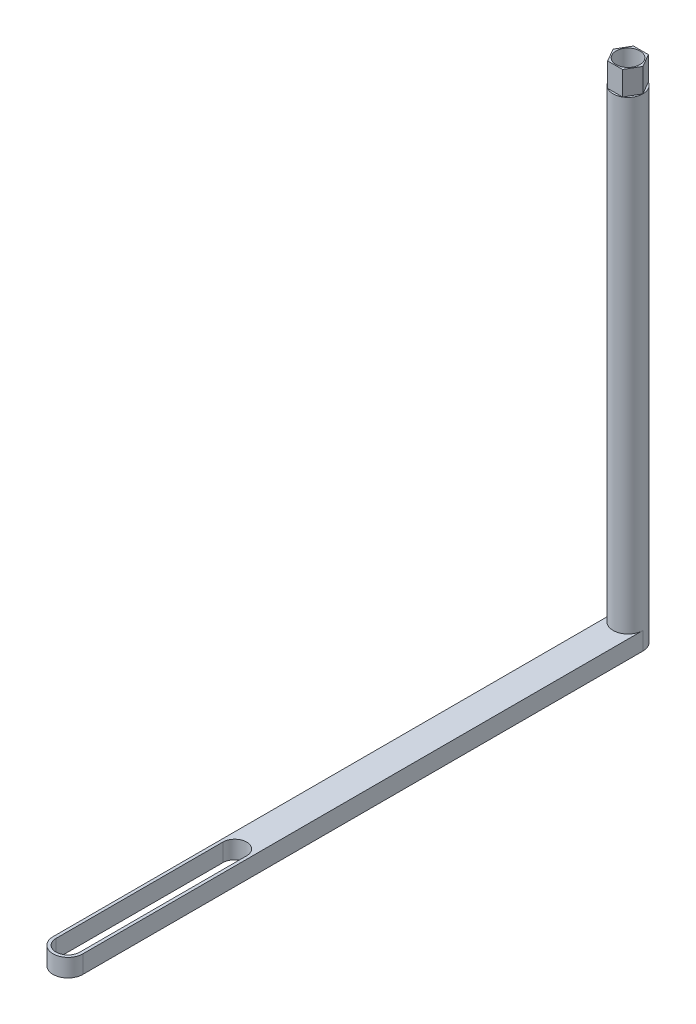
ISO-10303-21;
HEADER;
FILE_DESCRIPTION(('STEP AP214'),'2;1');
FILE_NAME('part.step','',(''),(''),'','','');
FILE_SCHEMA(('AUTOMOTIVE_DESIGN { 1 0 10303 214 1 1 1 1 }'));
ENDSEC;
DATA;
#1=APPLICATION_CONTEXT('core data for automotive mechanical design processes');
#2=APPLICATION_PROTOCOL_DEFINITION('international standard','automotive_design',2000,#1);
#3=PRODUCT_CONTEXT('',#1,'mechanical');
#4=PRODUCT('Part','Part','',(#3));
#5=PRODUCT_RELATED_PRODUCT_CATEGORY('part','',(#4));
#6=PRODUCT_DEFINITION_FORMATION('','',#4);
#7=PRODUCT_DEFINITION_CONTEXT('part definition',#1,'design');
#8=PRODUCT_DEFINITION('design','',#6,#7);
#9=PRODUCT_DEFINITION_SHAPE('','',#8);
#10=(LENGTH_UNIT() NAMED_UNIT(*) SI_UNIT(.MILLI.,.METRE.));
#11=(NAMED_UNIT(*) PLANE_ANGLE_UNIT() SI_UNIT($,.RADIAN.));
#12=(NAMED_UNIT(*) SI_UNIT($,.STERADIAN.) SOLID_ANGLE_UNIT());
#13=UNCERTAINTY_MEASURE_WITH_UNIT(LENGTH_MEASURE(1.E-05),#10,'distance_accuracy_value','');
#14=(GEOMETRIC_REPRESENTATION_CONTEXT(3) GLOBAL_UNCERTAINTY_ASSIGNED_CONTEXT((#13)) GLOBAL_UNIT_ASSIGNED_CONTEXT((#10,
#11,#12)) REPRESENTATION_CONTEXT('',''));
#15=CARTESIAN_POINT('',(0.,0.,0.));
#16=DIRECTION('',(0.,0.,1.));
#17=DIRECTION('',(1.,0.,0.));
#18=AXIS2_PLACEMENT_3D('',#15,#16,#17);
#19=CARTESIAN_POINT('',(0.,42.5,0.));
#20=DIRECTION('',(0.,-1.,0.));
#21=DIRECTION('',(0.,0.,-1.));
#22=AXIS2_PLACEMENT_3D('',#19,#20,#21);
#23=CYLINDRICAL_SURFACE('',#22,1.25);
#24=CARTESIAN_POINT('',(0.,1.5,0.));
#25=DIRECTION('',(0.,-1.,0.));
#26=DIRECTION('',(0.,0.,-1.));
#27=AXIS2_PLACEMENT_3D('',#24,#25,#26);
#28=CIRCLE('',#27,1.25);
#29=CARTESIAN_POINT('',(1.25,1.5,0.));
#30=VERTEX_POINT('',#29);
#31=CARTESIAN_POINT('',(-1.25,1.5,0.));
#32=VERTEX_POINT('',#31);
#33=EDGE_CURVE('E49',#30,#32,#28,.T.);
#34=ORIENTED_EDGE('',*,*,#33,.F.);
#35=DIRECTION('',(0.,-1.,0.));
#36=VECTOR('',#35,1.);
#37=CARTESIAN_POINT('',(1.25,1.5,0.));
#38=LINE('',#37,#36);
#39=CARTESIAN_POINT('',(1.25,0.,0.));
#40=VERTEX_POINT('',#39);
#41=EDGE_CURVE('E218',#30,#40,#38,.T.);
#42=ORIENTED_EDGE('',*,*,#41,.T.);
#43=CARTESIAN_POINT('',(0.,0.,0.));
#44=DIRECTION('',(0.,1.,0.));
#45=DIRECTION('',(0.,0.,1.));
#46=AXIS2_PLACEMENT_3D('',#43,#44,#45);
#47=CIRCLE('',#46,1.25);
#48=CARTESIAN_POINT('',(-1.25,0.,0.));
#49=VERTEX_POINT('',#48);
#50=EDGE_CURVE('E11',#40,#49,#47,.T.);
#51=ORIENTED_EDGE('',*,*,#50,.T.);
#52=DIRECTION('',(0.,-1.,0.));
#53=VECTOR('',#52,1.);
#54=CARTESIAN_POINT('',(-1.25,1.5,0.));
#55=LINE('',#54,#53);
#56=EDGE_CURVE('E53',#32,#49,#55,.T.);
#57=ORIENTED_EDGE('',*,*,#56,.F.);
#58=EDGE_LOOP('',(#34,#42,#51,#57));
#59=FACE_BOUND('',#58,.T.);
#60=CARTESIAN_POINT('',(0.,40.5,0.));
#61=DIRECTION('',(0.,1.,0.));
#62=DIRECTION('',(0.,0.,1.));
#63=AXIS2_PLACEMENT_3D('',#60,#61,#62);
#64=CIRCLE('',#63,1.25);
#65=CARTESIAN_POINT('',(-0.625000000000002,40.5,1.08253175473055));
#66=VERTEX_POINT('',#65);
#67=CARTESIAN_POINT('',(0.624999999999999,40.5,1.08253175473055));
#68=VERTEX_POINT('',#67);
#69=EDGE_CURVE('E150',#66,#68,#64,.T.);
#70=ORIENTED_EDGE('',*,*,#69,.F.);
#71=CARTESIAN_POINT('',(0.,40.5,0.));
#72=DIRECTION('',(0.,1.,0.));
#73=DIRECTION('',(0.,0.,1.));
#74=AXIS2_PLACEMENT_3D('',#71,#72,#73);
#75=CIRCLE('',#74,1.25);
#76=CARTESIAN_POINT('',(-1.25,40.5,0.));
#77=VERTEX_POINT('',#76);
#78=EDGE_CURVE('E158',#77,#66,#75,.T.);
#79=ORIENTED_EDGE('',*,*,#78,.F.);
#80=CARTESIAN_POINT('',(0.,40.5,0.));
#81=DIRECTION('',(0.,1.,0.));
#82=DIRECTION('',(0.,0.,1.));
#83=AXIS2_PLACEMENT_3D('',#80,#81,#82);
#84=CIRCLE('',#83,1.25);
#85=CARTESIAN_POINT('',(-0.624999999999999,40.5,-1.08253175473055));
#86=VERTEX_POINT('',#85);
#87=EDGE_CURVE('E266',#86,#77,#84,.T.);
#88=ORIENTED_EDGE('',*,*,#87,.F.);
#89=CARTESIAN_POINT('',(0.,40.5,0.));
#90=DIRECTION('',(0.,1.,0.));
#91=DIRECTION('',(0.,0.,1.));
#92=AXIS2_PLACEMENT_3D('',#89,#90,#91);
#93=CIRCLE('',#92,1.25);
#94=CARTESIAN_POINT('',(0.625000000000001,40.5,-1.08253175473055));
#95=VERTEX_POINT('',#94);
#96=EDGE_CURVE('E269',#95,#86,#93,.T.);
#97=ORIENTED_EDGE('',*,*,#96,.F.);
#98=CARTESIAN_POINT('',(0.,40.5,0.));
#99=DIRECTION('',(0.,1.,0.));
#100=DIRECTION('',(0.,0.,1.));
#101=AXIS2_PLACEMENT_3D('',#98,#99,#100);
#102=CIRCLE('',#101,1.25);
#103=CARTESIAN_POINT('',(1.25,40.5,0.));
#104=VERTEX_POINT('',#103);
#105=EDGE_CURVE('E278',#104,#95,#102,.T.);
#106=ORIENTED_EDGE('',*,*,#105,.F.);
#107=CARTESIAN_POINT('',(0.,40.5,0.));
#108=DIRECTION('',(0.,1.,0.));
#109=DIRECTION('',(0.,0.,1.));
#110=AXIS2_PLACEMENT_3D('',#107,#108,#109);
#111=CIRCLE('',#110,1.25);
#112=EDGE_CURVE('E160',#68,#104,#111,.T.);
#113=ORIENTED_EDGE('',*,*,#112,.F.);
#114=EDGE_LOOP('',(#70,#79,#88,#97,#106,#113));
#115=FACE_BOUND('',#114,.T.);
#116=ADVANCED_FACE('F35',(#59,#115),#23,.T.);
#117=CARTESIAN_POINT('',(0.,42.5,0.));
#118=DIRECTION('',(0.,1.,0.));
#119=DIRECTION('',(0.,0.,1.));
#120=AXIS2_PLACEMENT_3D('',#117,#118,#119);
#121=PLANE('',#120);
#122=CARTESIAN_POINT('',(0.,42.5,0.));
#123=DIRECTION('',(0.,1.,0.));
#124=DIRECTION('',(0.,0.,1.));
#125=AXIS2_PLACEMENT_3D('',#122,#123,#124);
#126=CIRCLE('',#125,1.);
#127=CARTESIAN_POINT('',(0.,42.5,1.));
#128=VERTEX_POINT('',#127);
#129=EDGE_CURVE('E42',#128,#128,#126,.T.);
#130=ORIENTED_EDGE('',*,*,#129,.F.);
#131=EDGE_LOOP('',(#130));
#132=FACE_BOUND('',#131,.T.);
#133=DIRECTION('',(0.5,0.,0.866025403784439));
#134=VECTOR('',#133,1.);
#135=CARTESIAN_POINT('',(-0.937500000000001,42.5,0.541265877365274));
#136=LINE('',#135,#134);
#137=CARTESIAN_POINT('',(-1.25,42.5,0.));
#138=VERTEX_POINT('',#137);
#139=CARTESIAN_POINT('',(-0.625000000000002,42.5,1.08253175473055));
#140=VERTEX_POINT('',#139);
#141=EDGE_CURVE('E167',#138,#140,#136,.T.);
#142=ORIENTED_EDGE('',*,*,#141,.T.);
#143=DIRECTION('',(1.,0.,0.));
#144=VECTOR('',#143,1.);
#145=CARTESIAN_POINT('',(0.,42.5,1.08253175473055));
#146=LINE('',#145,#144);
#147=CARTESIAN_POINT('',(0.624999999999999,42.5,1.08253175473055));
#148=VERTEX_POINT('',#147);
#149=EDGE_CURVE('E139',#140,#148,#146,.T.);
#150=ORIENTED_EDGE('',*,*,#149,.T.);
#151=DIRECTION('',(0.5,0.,-0.866025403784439));
#152=VECTOR('',#151,1.);
#153=CARTESIAN_POINT('',(0.937500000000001,42.5,0.541265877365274));
#154=LINE('',#153,#152);
#155=CARTESIAN_POINT('',(1.25,42.5,0.));
#156=VERTEX_POINT('',#155);
#157=EDGE_CURVE('E151',#148,#156,#154,.T.);
#158=ORIENTED_EDGE('',*,*,#157,.T.);
#159=DIRECTION('',(-0.5,0.,-0.866025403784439));
#160=VECTOR('',#159,1.);
#161=CARTESIAN_POINT('',(0.937500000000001,42.5,-0.541265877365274));
#162=LINE('',#161,#160);
#163=CARTESIAN_POINT('',(0.625000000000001,42.5,-1.08253175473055));
#164=VERTEX_POINT('',#163);
#165=EDGE_CURVE('E291',#156,#164,#162,.T.);
#166=ORIENTED_EDGE('',*,*,#165,.T.);
#167=DIRECTION('',(-1.,0.,0.));
#168=VECTOR('',#167,1.);
#169=CARTESIAN_POINT('',(0.,42.5,-1.08253175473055));
#170=LINE('',#169,#168);
#171=CARTESIAN_POINT('',(-0.624999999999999,42.5,-1.08253175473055));
#172=VERTEX_POINT('',#171);
#173=EDGE_CURVE('E260',#164,#172,#170,.T.);
#174=ORIENTED_EDGE('',*,*,#173,.T.);
#175=DIRECTION('',(-0.5,0.,0.866025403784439));
#176=VECTOR('',#175,1.);
#177=CARTESIAN_POINT('',(-0.9375,42.5,-0.541265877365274));
#178=LINE('',#177,#176);
#179=EDGE_CURVE('E257',#172,#138,#178,.T.);
#180=ORIENTED_EDGE('',*,*,#179,.T.);
#181=EDGE_LOOP('',(#142,#150,#158,#166,#174,#180));
#182=FACE_BOUND('',#181,.T.);
#183=ADVANCED_FACE('F248',(#132,#182),#121,.T.);
#184=CARTESIAN_POINT('',(0.,0.,0.));
#185=DIRECTION('',(0.,1.,0.));
#186=DIRECTION('',(0.,0.,1.));
#187=AXIS2_PLACEMENT_3D('',#184,#185,#186);
#188=PLANE('',#187);
#189=ORIENTED_EDGE('',*,*,#50,.F.);
#190=DIRECTION('',(0.,0.,1.));
#191=VECTOR('',#190,1.);
#192=CARTESIAN_POINT('',(1.25,0.,0.));
#193=LINE('',#192,#191);
#194=CARTESIAN_POINT('',(1.25,0.,47.));
#195=VERTEX_POINT('',#194);
#196=EDGE_CURVE('E201',#40,#195,#193,.T.);
#197=ORIENTED_EDGE('',*,*,#196,.T.);
#198=CARTESIAN_POINT('',(0.,0.,47.));
#199=DIRECTION('',(0.,-1.,0.));
#200=DIRECTION('',(0.,0.,-1.));
#201=AXIS2_PLACEMENT_3D('',#198,#199,#200);
#202=CIRCLE('',#201,1.25);
#203=CARTESIAN_POINT('',(-1.25,0.,47.));
#204=VERTEX_POINT('',#203);
#205=EDGE_CURVE('E221',#195,#204,#202,.T.);
#206=ORIENTED_EDGE('',*,*,#205,.T.);
#207=DIRECTION('',(0.,0.,-1.));
#208=VECTOR('',#207,1.);
#209=CARTESIAN_POINT('',(-1.25,0.,0.));
#210=LINE('',#209,#208);
#211=EDGE_CURVE('E212',#204,#49,#210,.T.);
#212=ORIENTED_EDGE('',*,*,#211,.T.);
#213=EDGE_LOOP('',(#189,#197,#206,#212));
#214=FACE_BOUND('',#213,.T.);
#215=CARTESIAN_POINT('',(0.,0.,0.));
#216=DIRECTION('',(0.,1.,0.));
#217=DIRECTION('',(0.,0.,1.));
#218=AXIS2_PLACEMENT_3D('',#215,#216,#217);
#219=CIRCLE('',#218,1.);
#220=CARTESIAN_POINT('',(0.,0.,1.));
#221=VERTEX_POINT('',#220);
#222=EDGE_CURVE('E233',#221,#221,#219,.T.);
#223=ORIENTED_EDGE('',*,*,#222,.T.);
#224=EDGE_LOOP('',(#223));
#225=FACE_BOUND('',#224,.T.);
#226=CARTESIAN_POINT('',(0.,0.,47.));
#227=DIRECTION('',(0.,-1.,0.));
#228=DIRECTION('',(0.,0.,-1.));
#229=AXIS2_PLACEMENT_3D('',#226,#227,#228);
#230=CIRCLE('',#229,1.);
#231=CARTESIAN_POINT('',(1.,0.,47.));
#232=VERTEX_POINT('',#231);
#233=CARTESIAN_POINT('',(-1.,0.,47.));
#234=VERTEX_POINT('',#233);
#235=EDGE_CURVE('E144',#232,#234,#230,.T.);
#236=ORIENTED_EDGE('',*,*,#235,.F.);
#237=DIRECTION('',(0.,0.,1.));
#238=VECTOR('',#237,1.);
#239=CARTESIAN_POINT('',(1.,0.,47.));
#240=LINE('',#239,#238);
#241=CARTESIAN_POINT('',(1.,0.,33.));
#242=VERTEX_POINT('',#241);
#243=EDGE_CURVE('E180',#242,#232,#240,.T.);
#244=ORIENTED_EDGE('',*,*,#243,.F.);
#245=CARTESIAN_POINT('',(0.,0.,33.));
#246=DIRECTION('',(0.,-1.,0.));
#247=DIRECTION('',(0.,0.,-1.));
#248=AXIS2_PLACEMENT_3D('',#245,#246,#247);
#249=CIRCLE('',#248,1.);
#250=CARTESIAN_POINT('',(-0.999999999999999,0.,33.));
#251=VERTEX_POINT('',#250);
#252=EDGE_CURVE('E194',#251,#242,#249,.T.);
#253=ORIENTED_EDGE('',*,*,#252,.F.);
#254=DIRECTION('',(0.,0.,-1.));
#255=VECTOR('',#254,1.);
#256=CARTESIAN_POINT('',(-1.,0.,47.));
#257=LINE('',#256,#255);
#258=EDGE_CURVE('E191',#234,#251,#257,.T.);
#259=ORIENTED_EDGE('',*,*,#258,.F.);
#260=EDGE_LOOP('',(#236,#244,#253,#259));
#261=FACE_BOUND('',#260,.T.);
#262=ADVANCED_FACE('F238',(#214,#225,#261),#188,.F.);
#263=CARTESIAN_POINT('',(0.,42.5,0.));
#264=DIRECTION('',(0.,-1.,0.));
#265=DIRECTION('',(0.,0.,-1.));
#266=AXIS2_PLACEMENT_3D('',#263,#264,#265);
#267=CYLINDRICAL_SURFACE('',#266,1.);
#268=ORIENTED_EDGE('',*,*,#222,.F.);
#269=EDGE_LOOP('',(#268));
#270=FACE_BOUND('',#269,.T.);
#271=ORIENTED_EDGE('',*,*,#129,.T.);
#272=EDGE_LOOP('',(#271));
#273=FACE_BOUND('',#272,.T.);
#274=ADVANCED_FACE('F241',(#270,#273),#267,.F.);
#275=CARTESIAN_POINT('',(0.,1.5,0.));
#276=DIRECTION('',(0.,-1.,0.));
#277=DIRECTION('',(0.,0.,-1.));
#278=AXIS2_PLACEMENT_3D('',#275,#276,#277);
#279=PLANE('',#278);
#280=DIRECTION('',(0.,0.,1.));
#281=VECTOR('',#280,1.);
#282=CARTESIAN_POINT('',(1.,1.5,47.));
#283=LINE('',#282,#281);
#284=CARTESIAN_POINT('',(1.,1.5,33.));
#285=VERTEX_POINT('',#284);
#286=CARTESIAN_POINT('',(1.,1.5,47.));
#287=VERTEX_POINT('',#286);
#288=EDGE_CURVE('E186',#285,#287,#283,.T.);
#289=ORIENTED_EDGE('',*,*,#288,.T.);
#290=CARTESIAN_POINT('',(0.,1.5,47.));
#291=DIRECTION('',(0.,-1.,0.));
#292=DIRECTION('',(0.,0.,-1.));
#293=AXIS2_PLACEMENT_3D('',#290,#291,#292);
#294=CIRCLE('',#293,1.);
#295=CARTESIAN_POINT('',(-1.,1.5,47.));
#296=VERTEX_POINT('',#295);
#297=EDGE_CURVE('E176',#287,#296,#294,.T.);
#298=ORIENTED_EDGE('',*,*,#297,.T.);
#299=DIRECTION('',(0.,0.,-1.));
#300=VECTOR('',#299,1.);
#301=CARTESIAN_POINT('',(-1.,1.5,47.));
#302=LINE('',#301,#300);
#303=CARTESIAN_POINT('',(-0.999999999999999,1.5,33.));
#304=VERTEX_POINT('',#303);
#305=EDGE_CURVE('E179',#296,#304,#302,.T.);
#306=ORIENTED_EDGE('',*,*,#305,.T.);
#307=CARTESIAN_POINT('',(0.,1.5,33.));
#308=DIRECTION('',(0.,-1.,0.));
#309=DIRECTION('',(0.,0.,-1.));
#310=AXIS2_PLACEMENT_3D('',#307,#308,#309);
#311=CIRCLE('',#310,1.);
#312=EDGE_CURVE('E183',#304,#285,#311,.T.);
#313=ORIENTED_EDGE('',*,*,#312,.T.);
#314=EDGE_LOOP('',(#289,#298,#306,#313));
#315=FACE_BOUND('',#314,.T.);
#316=DIRECTION('',(0.,0.,1.));
#317=VECTOR('',#316,1.);
#318=CARTESIAN_POINT('',(1.25,1.5,0.));
#319=LINE('',#318,#317);
#320=CARTESIAN_POINT('',(1.25,1.5,47.));
#321=VERTEX_POINT('',#320);
#322=EDGE_CURVE('E208',#30,#321,#319,.T.);
#323=ORIENTED_EDGE('',*,*,#322,.F.);
#324=ORIENTED_EDGE('',*,*,#33,.T.);
#325=DIRECTION('',(0.,0.,-1.));
#326=VECTOR('',#325,1.);
#327=CARTESIAN_POINT('',(-1.25,1.5,0.));
#328=LINE('',#327,#326);
#329=CARTESIAN_POINT('',(-1.25,1.5,47.));
#330=VERTEX_POINT('',#329);
#331=EDGE_CURVE('E215',#330,#32,#328,.T.);
#332=ORIENTED_EDGE('',*,*,#331,.F.);
#333=CARTESIAN_POINT('',(0.,1.5,47.));
#334=DIRECTION('',(0.,-1.,0.));
#335=DIRECTION('',(0.,0.,-1.));
#336=AXIS2_PLACEMENT_3D('',#333,#334,#335);
#337=CIRCLE('',#336,1.25);
#338=EDGE_CURVE('E211',#321,#330,#337,.T.);
#339=ORIENTED_EDGE('',*,*,#338,.F.);
#340=EDGE_LOOP('',(#323,#324,#332,#339));
#341=FACE_BOUND('',#340,.T.);
#342=ADVANCED_FACE('F244',(#315,#341),#279,.F.);
#343=CARTESIAN_POINT('',(-1.25,1.5,0.));
#344=DIRECTION('',(-1.,0.,0.));
#345=DIRECTION('',(0.,0.,1.));
#346=AXIS2_PLACEMENT_3D('',#343,#344,#345);
#347=PLANE('',#346);
#348=ORIENTED_EDGE('',*,*,#211,.F.);
#349=DIRECTION('',(0.,-1.,0.));
#350=VECTOR('',#349,1.);
#351=CARTESIAN_POINT('',(-1.25,1.5,47.));
#352=LINE('',#351,#350);
#353=EDGE_CURVE('E227',#330,#204,#352,.T.);
#354=ORIENTED_EDGE('',*,*,#353,.F.);
#355=ORIENTED_EDGE('',*,*,#331,.T.);
#356=ORIENTED_EDGE('',*,*,#56,.T.);
#357=EDGE_LOOP('',(#348,#354,#355,#356));
#358=FACE_BOUND('',#357,.T.);
#359=ADVANCED_FACE('F342',(#358),#347,.T.);
#360=CARTESIAN_POINT('',(0.,1.5,47.));
#361=DIRECTION('',(0.,-1.,0.));
#362=DIRECTION('',(0.,0.,-1.));
#363=AXIS2_PLACEMENT_3D('',#360,#361,#362);
#364=CYLINDRICAL_SURFACE('',#363,1.25);
#365=ORIENTED_EDGE('',*,*,#205,.F.);
#366=DIRECTION('',(0.,-1.,0.));
#367=VECTOR('',#366,1.);
#368=CARTESIAN_POINT('',(1.25,1.5,47.));
#369=LINE('',#368,#367);
#370=EDGE_CURVE('E229',#321,#195,#369,.T.);
#371=ORIENTED_EDGE('',*,*,#370,.F.);
#372=ORIENTED_EDGE('',*,*,#338,.T.);
#373=ORIENTED_EDGE('',*,*,#353,.T.);
#374=EDGE_LOOP('',(#365,#371,#372,#373));
#375=FACE_BOUND('',#374,.T.);
#376=ADVANCED_FACE('F350',(#375),#364,.T.);
#377=CARTESIAN_POINT('',(1.25,1.5,0.));
#378=DIRECTION('',(1.,0.,0.));
#379=DIRECTION('',(0.,0.,-1.));
#380=AXIS2_PLACEMENT_3D('',#377,#378,#379);
#381=PLANE('',#380);
#382=ORIENTED_EDGE('',*,*,#196,.F.);
#383=ORIENTED_EDGE('',*,*,#41,.F.);
#384=ORIENTED_EDGE('',*,*,#322,.T.);
#385=ORIENTED_EDGE('',*,*,#370,.T.);
#386=EDGE_LOOP('',(#382,#383,#384,#385));
#387=FACE_BOUND('',#386,.T.);
#388=ADVANCED_FACE('F358',(#387),#381,.T.);
#389=CARTESIAN_POINT('',(0.,1.5,47.));
#390=DIRECTION('',(0.,-1.,0.));
#391=DIRECTION('',(0.,0.,-1.));
#392=AXIS2_PLACEMENT_3D('',#389,#390,#391);
#393=CYLINDRICAL_SURFACE('',#392,1.);
#394=ORIENTED_EDGE('',*,*,#235,.T.);
#395=DIRECTION('',(0.,-1.,0.));
#396=VECTOR('',#395,1.);
#397=CARTESIAN_POINT('',(-1.,1.5,47.));
#398=LINE('',#397,#396);
#399=EDGE_CURVE('E189',#296,#234,#398,.T.);
#400=ORIENTED_EDGE('',*,*,#399,.F.);
#401=ORIENTED_EDGE('',*,*,#297,.F.);
#402=DIRECTION('',(0.,-1.,0.));
#403=VECTOR('',#402,1.);
#404=CARTESIAN_POINT('',(1.,1.5,47.));
#405=LINE('',#404,#403);
#406=EDGE_CURVE('E199',#287,#232,#405,.T.);
#407=ORIENTED_EDGE('',*,*,#406,.T.);
#408=EDGE_LOOP('',(#394,#400,#401,#407));
#409=FACE_BOUND('',#408,.T.);
#410=ADVANCED_FACE('F366',(#409),#393,.F.);
#411=CARTESIAN_POINT('',(1.,1.5,47.));
#412=DIRECTION('',(1.,0.,0.));
#413=DIRECTION('',(0.,0.,-1.));
#414=AXIS2_PLACEMENT_3D('',#411,#412,#413);
#415=PLANE('',#414);
#416=ORIENTED_EDGE('',*,*,#243,.T.);
#417=ORIENTED_EDGE('',*,*,#406,.F.);
#418=ORIENTED_EDGE('',*,*,#288,.F.);
#419=DIRECTION('',(0.,-1.,0.));
#420=VECTOR('',#419,1.);
#421=CARTESIAN_POINT('',(1.,1.5,33.));
#422=LINE('',#421,#420);
#423=EDGE_CURVE('E202',#285,#242,#422,.T.);
#424=ORIENTED_EDGE('',*,*,#423,.T.);
#425=EDGE_LOOP('',(#416,#417,#418,#424));
#426=FACE_BOUND('',#425,.T.);
#427=ADVANCED_FACE('F374',(#426),#415,.F.);
#428=CARTESIAN_POINT('',(0.,1.5,33.));
#429=DIRECTION('',(0.,-1.,0.));
#430=DIRECTION('',(0.,0.,-1.));
#431=AXIS2_PLACEMENT_3D('',#428,#429,#430);
#432=CYLINDRICAL_SURFACE('',#431,1.);
#433=ORIENTED_EDGE('',*,*,#252,.T.);
#434=ORIENTED_EDGE('',*,*,#423,.F.);
#435=ORIENTED_EDGE('',*,*,#312,.F.);
#436=DIRECTION('',(0.,-1.,0.));
#437=VECTOR('',#436,1.);
#438=CARTESIAN_POINT('',(-0.999999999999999,1.5,33.));
#439=LINE('',#438,#437);
#440=EDGE_CURVE('E204',#304,#251,#439,.T.);
#441=ORIENTED_EDGE('',*,*,#440,.T.);
#442=EDGE_LOOP('',(#433,#434,#435,#441));
#443=FACE_BOUND('',#442,.T.);
#444=ADVANCED_FACE('F382',(#443),#432,.F.);
#445=CARTESIAN_POINT('',(-1.,1.5,47.));
#446=DIRECTION('',(-1.,0.,0.));
#447=DIRECTION('',(0.,0.,1.));
#448=AXIS2_PLACEMENT_3D('',#445,#446,#447);
#449=PLANE('',#448);
#450=ORIENTED_EDGE('',*,*,#258,.T.);
#451=ORIENTED_EDGE('',*,*,#440,.F.);
#452=ORIENTED_EDGE('',*,*,#305,.F.);
#453=ORIENTED_EDGE('',*,*,#399,.T.);
#454=EDGE_LOOP('',(#450,#451,#452,#453));
#455=FACE_BOUND('',#454,.T.);
#456=ADVANCED_FACE('F390',(#455),#449,.F.);
#457=CARTESIAN_POINT('',(-0.937500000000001,40.5,0.541265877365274));
#458=DIRECTION('',(-0.866025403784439,0.,0.5));
#459=DIRECTION('',(0.5,0.,0.866025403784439));
#460=AXIS2_PLACEMENT_3D('',#457,#458,#459);
#461=PLANE('',#460);
#462=ORIENTED_EDGE('',*,*,#141,.F.);
#463=DIRECTION('',(0.,1.,0.));
#464=VECTOR('',#463,1.);
#465=CARTESIAN_POINT('',(-1.25,40.5,0.));
#466=LINE('',#465,#464);
#467=EDGE_CURVE('E145',#77,#138,#466,.T.);
#468=ORIENTED_EDGE('',*,*,#467,.F.);
#469=DIRECTION('',(0.5,0.,0.866025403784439));
#470=VECTOR('',#469,1.);
#471=CARTESIAN_POINT('',(-0.937500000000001,40.5,0.541265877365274));
#472=LINE('',#471,#470);
#473=EDGE_CURVE('E164',#77,#66,#472,.T.);
#474=ORIENTED_EDGE('',*,*,#473,.T.);
#475=DIRECTION('',(0.,1.,0.));
#476=VECTOR('',#475,1.);
#477=CARTESIAN_POINT('',(-0.625000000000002,40.5,1.08253175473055));
#478=LINE('',#477,#476);
#479=EDGE_CURVE('E133',#66,#140,#478,.T.);
#480=ORIENTED_EDGE('',*,*,#479,.T.);
#481=EDGE_LOOP('',(#462,#468,#474,#480));
#482=FACE_BOUND('',#481,.T.);
#483=ADVANCED_FACE('F165',(#482),#461,.T.);
#484=CARTESIAN_POINT('',(0.,40.5,0.));
#485=DIRECTION('',(0.,1.,0.));
#486=DIRECTION('',(0.,0.,1.));
#487=AXIS2_PLACEMENT_3D('',#484,#485,#486);
#488=PLANE('',#487);
#489=ORIENTED_EDGE('',*,*,#473,.F.);
#490=ORIENTED_EDGE('',*,*,#78,.T.);
#491=EDGE_LOOP('',(#489,#490));
#492=FACE_BOUND('',#491,.T.);
#493=ADVANCED_FACE('F169',(#492),#488,.T.);
#494=CARTESIAN_POINT('',(-0.9375,40.5,-0.541265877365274));
#495=DIRECTION('',(-0.866025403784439,0.,-0.5));
#496=DIRECTION('',(-0.5,0.,0.866025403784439));
#497=AXIS2_PLACEMENT_3D('',#494,#495,#496);
#498=PLANE('',#497);
#499=ORIENTED_EDGE('',*,*,#179,.F.);
#500=DIRECTION('',(0.,1.,0.));
#501=VECTOR('',#500,1.);
#502=CARTESIAN_POINT('',(-0.624999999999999,40.5,-1.08253175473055));
#503=LINE('',#502,#501);
#504=EDGE_CURVE('E263',#86,#172,#503,.T.);
#505=ORIENTED_EDGE('',*,*,#504,.F.);
#506=DIRECTION('',(-0.5,0.,0.866025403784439));
#507=VECTOR('',#506,1.);
#508=CARTESIAN_POINT('',(-0.9375,40.5,-0.541265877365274));
#509=LINE('',#508,#507);
#510=EDGE_CURVE('E174',#86,#77,#509,.T.);
#511=ORIENTED_EDGE('',*,*,#510,.T.);
#512=ORIENTED_EDGE('',*,*,#467,.T.);
#513=EDGE_LOOP('',(#499,#505,#511,#512));
#514=FACE_BOUND('',#513,.T.);
#515=ADVANCED_FACE('F274',(#514),#498,.T.);
#516=CARTESIAN_POINT('',(0.,40.5,0.));
#517=DIRECTION('',(0.,1.,0.));
#518=DIRECTION('',(0.,0.,1.));
#519=AXIS2_PLACEMENT_3D('',#516,#517,#518);
#520=PLANE('',#519);
#521=ORIENTED_EDGE('',*,*,#510,.F.);
#522=ORIENTED_EDGE('',*,*,#87,.T.);
#523=EDGE_LOOP('',(#521,#522));
#524=FACE_BOUND('',#523,.T.);
#525=ADVANCED_FACE('F276',(#524),#520,.T.);
#526=CARTESIAN_POINT('',(0.,40.5,-1.08253175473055));
#527=DIRECTION('',(0.,0.,-1.));
#528=DIRECTION('',(-1.,0.,0.));
#529=AXIS2_PLACEMENT_3D('',#526,#527,#528);
#530=PLANE('',#529);
#531=ORIENTED_EDGE('',*,*,#173,.F.);
#532=DIRECTION('',(0.,1.,0.));
#533=VECTOR('',#532,1.);
#534=CARTESIAN_POINT('',(0.625000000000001,40.5,-1.08253175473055));
#535=LINE('',#534,#533);
#536=EDGE_CURVE('E281',#95,#164,#535,.T.);
#537=ORIENTED_EDGE('',*,*,#536,.F.);
#538=DIRECTION('',(-1.,0.,0.));
#539=VECTOR('',#538,1.);
#540=CARTESIAN_POINT('',(0.,40.5,-1.08253175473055));
#541=LINE('',#540,#539);
#542=EDGE_CURVE('E264',#95,#86,#541,.T.);
#543=ORIENTED_EDGE('',*,*,#542,.T.);
#544=ORIENTED_EDGE('',*,*,#504,.T.);
#545=EDGE_LOOP('',(#531,#537,#543,#544));
#546=FACE_BOUND('',#545,.T.);
#547=ADVANCED_FACE('F421',(#546),#530,.T.);
#548=CARTESIAN_POINT('',(0.,40.5,0.));
#549=DIRECTION('',(0.,1.,0.));
#550=DIRECTION('',(0.,0.,1.));
#551=AXIS2_PLACEMENT_3D('',#548,#549,#550);
#552=PLANE('',#551);
#553=ORIENTED_EDGE('',*,*,#542,.F.);
#554=ORIENTED_EDGE('',*,*,#96,.T.);
#555=EDGE_LOOP('',(#553,#554));
#556=FACE_BOUND('',#555,.T.);
#557=ADVANCED_FACE('F428',(#556),#552,.T.);
#558=CARTESIAN_POINT('',(0.937500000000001,40.5,-0.541265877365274));
#559=DIRECTION('',(0.866025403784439,0.,-0.5));
#560=DIRECTION('',(-0.5,0.,-0.866025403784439));
#561=AXIS2_PLACEMENT_3D('',#558,#559,#560);
#562=PLANE('',#561);
#563=ORIENTED_EDGE('',*,*,#165,.F.);
#564=DIRECTION('',(0.,1.,0.));
#565=VECTOR('',#564,1.);
#566=CARTESIAN_POINT('',(1.25,40.5,0.));
#567=LINE('',#566,#565);
#568=EDGE_CURVE('E290',#104,#156,#567,.T.);
#569=ORIENTED_EDGE('',*,*,#568,.F.);
#570=DIRECTION('',(-0.5,0.,-0.866025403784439));
#571=VECTOR('',#570,1.);
#572=CARTESIAN_POINT('',(0.937500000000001,40.5,-0.541265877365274));
#573=LINE('',#572,#571);
#574=EDGE_CURVE('E285',#104,#95,#573,.T.);
#575=ORIENTED_EDGE('',*,*,#574,.T.);
#576=ORIENTED_EDGE('',*,*,#536,.T.);
#577=EDGE_LOOP('',(#563,#569,#575,#576));
#578=FACE_BOUND('',#577,.T.);
#579=ADVANCED_FACE('F436',(#578),#562,.T.);
#580=CARTESIAN_POINT('',(0.,40.5,0.));
#581=DIRECTION('',(0.,1.,0.));
#582=DIRECTION('',(0.,0.,1.));
#583=AXIS2_PLACEMENT_3D('',#580,#581,#582);
#584=PLANE('',#583);
#585=ORIENTED_EDGE('',*,*,#574,.F.);
#586=ORIENTED_EDGE('',*,*,#105,.T.);
#587=EDGE_LOOP('',(#585,#586));
#588=FACE_BOUND('',#587,.T.);
#589=ADVANCED_FACE('F314',(#588),#584,.T.);
#590=CARTESIAN_POINT('',(0.937500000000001,40.5,0.541265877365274));
#591=DIRECTION('',(0.866025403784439,0.,0.5));
#592=DIRECTION('',(0.5,0.,-0.866025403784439));
#593=AXIS2_PLACEMENT_3D('',#590,#591,#592);
#594=PLANE('',#593);
#595=ORIENTED_EDGE('',*,*,#157,.F.);
#596=DIRECTION('',(0.,1.,0.));
#597=VECTOR('',#596,1.);
#598=CARTESIAN_POINT('',(0.624999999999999,40.5,1.08253175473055));
#599=LINE('',#598,#597);
#600=EDGE_CURVE('E298',#68,#148,#599,.T.);
#601=ORIENTED_EDGE('',*,*,#600,.F.);
#602=DIRECTION('',(0.5,0.,-0.866025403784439));
#603=VECTOR('',#602,1.);
#604=CARTESIAN_POINT('',(0.937500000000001,40.5,0.541265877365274));
#605=LINE('',#604,#603);
#606=EDGE_CURVE('E293',#68,#104,#605,.T.);
#607=ORIENTED_EDGE('',*,*,#606,.T.);
#608=ORIENTED_EDGE('',*,*,#568,.T.);
#609=EDGE_LOOP('',(#595,#601,#607,#608));
#610=FACE_BOUND('',#609,.T.);
#611=ADVANCED_FACE('F303',(#610),#594,.T.);
#612=CARTESIAN_POINT('',(0.,40.5,0.));
#613=DIRECTION('',(0.,1.,0.));
#614=DIRECTION('',(0.,0.,1.));
#615=AXIS2_PLACEMENT_3D('',#612,#613,#614);
#616=PLANE('',#615);
#617=ORIENTED_EDGE('',*,*,#606,.F.);
#618=ORIENTED_EDGE('',*,*,#112,.T.);
#619=EDGE_LOOP('',(#617,#618));
#620=FACE_BOUND('',#619,.T.);
#621=ADVANCED_FACE('F306',(#620),#616,.T.);
#622=CARTESIAN_POINT('',(0.,40.5,1.08253175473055));
#623=DIRECTION('',(0.,0.,1.));
#624=DIRECTION('',(1.,0.,0.));
#625=AXIS2_PLACEMENT_3D('',#622,#623,#624);
#626=PLANE('',#625);
#627=ORIENTED_EDGE('',*,*,#149,.F.);
#628=ORIENTED_EDGE('',*,*,#479,.F.);
#629=DIRECTION('',(1.,0.,0.));
#630=VECTOR('',#629,1.);
#631=CARTESIAN_POINT('',(0.,40.5,1.08253175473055));
#632=LINE('',#631,#630);
#633=EDGE_CURVE('E136',#66,#68,#632,.T.);
#634=ORIENTED_EDGE('',*,*,#633,.T.);
#635=ORIENTED_EDGE('',*,*,#600,.T.);
#636=EDGE_LOOP('',(#627,#628,#634,#635));
#637=FACE_BOUND('',#636,.T.);
#638=ADVANCED_FACE('F135',(#637),#626,.T.);
#639=CARTESIAN_POINT('',(0.,40.5,0.));
#640=DIRECTION('',(0.,1.,0.));
#641=DIRECTION('',(0.,0.,1.));
#642=AXIS2_PLACEMENT_3D('',#639,#640,#641);
#643=PLANE('',#642);
#644=ORIENTED_EDGE('',*,*,#633,.F.);
#645=ORIENTED_EDGE('',*,*,#69,.T.);
#646=EDGE_LOOP('',(#644,#645));
#647=FACE_BOUND('',#646,.T.);
#648=ADVANCED_FACE('F149',(#647),#643,.T.);
#649=CLOSED_SHELL('',(#116,#183,#262,#274,#342,#359,#376,#388,#410,#427,#444,#456,#483,#493,
#515,#525,#547,#557,#579,#589,#611,#621,#638,#648));
#650=MANIFOLD_SOLID_BREP('B2',#649);
#651=ADVANCED_BREP_SHAPE_REPRESENTATION('',(#18,#650),#14);
#652=SHAPE_DEFINITION_REPRESENTATION(#9,#651);
ENDSEC;
END-ISO-10303-21;
